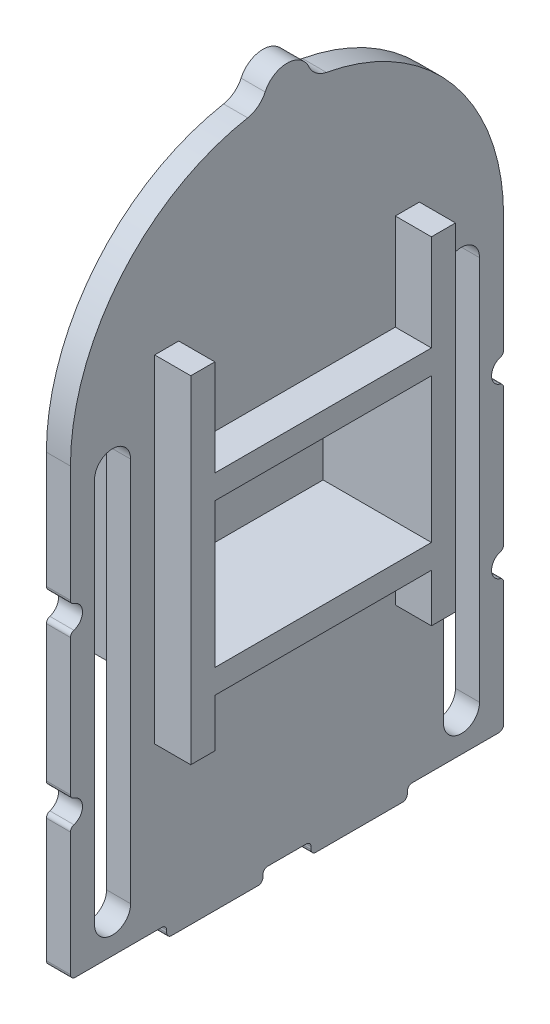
from build123d import *

# Parameters (mm, degrees)
EXTRUSION1_DEPTH        = 1
ESQUISSE2_W             = 11
ESQUISSE2_H             = 8
EXTRUSION2_DEPTH        = 3
CONG_1_R                = 1
EXTRUSION4_DEPTH        = 4
EXTRUSION4_DEPTH_BACK   = 4
CONG_2_R                = 0.2
ESQUISSE4_W             = 9
ESQUISSE4_H             = 6
ENL_V_MAT_EXTRU_1_DEPTH = 3
ESQUISSE5_W             = 9
ESQUISSE5_H             = 6
EXTRUSION5_DEPTH        = 1.5


with BuildPart() as part:
    # Esquisse1 → Extrusion1 (new body)
    with BuildSketch(Plane(origin=(0, 0, 0), x_dir=(0, 0, -1), z_dir=(1, 0, 0))):
        with BuildLine():
            Line((9, 0), (9, -5))
            ThreePointArc((9, -5), (8.5, -5.5), (9, -6))
            Line((9, -6), (9, -12))
            ThreePointArc((9, -12), (8.5, -12.5), (9, -13))
            Line((9, -13), (9, -18.5))
            Line((9, -18.5), (5, -18.5))
            Line((5, -18.5), (5, -19))
            Line((5, -19), (1, -19))
            Line((1, -19), (1, -18.5))
            Line((1, -18.5), (-1, -18.5))
            Line((-1, -18.5), (-1, -19))
            Line((-1, -19), (-5, -19))
            Line((-5, -19), (-5, -18.5))
            Line((-5, -18.5), (-9, -18.5))
            Line((-9, -18.5), (-9, -13))
            ThreePointArc((-9, -13), (-8.5, -12.5), (-9, -12))
            Line((-9, -12), (-9, -6))
            ThreePointArc((-9, -6), (-8.5, -5.5), (-9, -5))
            Line((-9, -5), (-9, 0))
            ThreePointArc((-9, 0), (-6.918336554, 5.75644155), (-1.636306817, 8.85))
            ThreePointArc((-1.636306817, 8.85), (-1.203482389, 9.044522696), (-0.909059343, 9.416666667))
            ThreePointArc((-0.909059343, 9.416666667), (0, 10), (0.909059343, 9.416666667))
            ThreePointArc((0.909059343, 9.416666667), (1.203482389, 9.044522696), (1.636306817, 8.85))
            ThreePointArc((1.636306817, 8.85), (6.918336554, 5.75644155), (9, 0))
        make_face()
        with BuildLine():
            Line((6.5, -1), (6.5, -17))
            ThreePointArc((6.5, -17), (7.25, -17.75), (8, -17))
            Line((8, -17), (8, -1))
            ThreePointArc((8, -1), (7.25, -0.25), (6.5, -1))
        make_face(mode=Mode.SUBTRACT)
        with BuildLine():
            Line((-8, -1), (-8, -17))
            ThreePointArc((-8, -17), (-7.25, -17.75), (-6.5, -17))
            Line((-6.5, -17), (-6.5, -1))
            ThreePointArc((-6.5, -1), (-7.25, -0.25), (-8, -1))
        make_face(mode=Mode.SUBTRACT)
    extrude(amount=EXTRUSION1_DEPTH)

    # Esquisse2 → Extrusion2 (add)
    with BuildSketch(Plane.ZY):
        with Locations((0, -5.75)):
            Rectangle(ESQUISSE2_W, ESQUISSE2_H)
    extrude(amount=EXTRUSION2_DEPTH)

    # Cong_1
    cong_1_edges = [part.edges().sort_by_distance(p)[0] for p in [
        (-3, -5.75, -5.5),
        (-3, -9.75, 0),
        (-3, -5.75, 5.5),
        (-3, -1.75, 0),
    ]]
    fillet(cong_1_edges, radius=CONG_1_R)

    # Esquisse3 → Extrusion4 (add, two sides: drawn at the far end of the back side and taken through both)
    with BuildSketch(Plane.XY.offset(-EXTRUSION4_DEPTH_BACK)):
        with BuildLine():
            Line((-3, -5.25), (-3, -6.25))
            ThreePointArc((-3, -6.25), (-3.5, -5.75), (-3, -5.25))
        make_face()
        with BuildLine():
            Line((-3, -3.05), (-3, -4.05))
            ThreePointArc((-3, -4.05), (-3.5, -3.55), (-3, -3.05))
        make_face()
        with BuildLine():
            Line((-3, -7.45), (-3, -8.45))
            ThreePointArc((-3, -8.45), (-3.5, -7.95), (-3, -7.45))
        make_face()
    extrude(amount=EXTRUSION4_DEPTH + EXTRUSION4_DEPTH_BACK)

    # Cong_2
    cong_2_edges = [part.edges().sort_by_distance(p)[0] for p in [
        (0.5, -18.5, -9),
        (0.5, -18.5, -5),
        (0.5, -19, -5),
        (0.5, -19, -1),
        (0.5, -18.5, -1),
        (0.5, -18.5, 1),
        (0.5, -19, 1),
        (0.5, -19, 5),
        (0.5, -18.5, 5),
        (0.5, -18.5, 9),
        (0.5, -13, 9),
        (0.5, -12, 9),
        (0.5, -6, 9),
        (0.5, -5, 9),
        (0.5, -5, -9),
        (0.5, -6, -9),
        (0.5, -12, -9),
        (0.5, -13, -9),
    ]]
    fillet(cong_2_edges, radius=CONG_2_R)

    # Esquisse4 → Enl_v. mat.-Extru.1 (cut)
    with BuildSketch(Plane(origin=(1, 0, 0), x_dir=(0, 0, -1), z_dir=(1, 0, 0))):
        with Locations((0, -5.75)):
            Rectangle(ESQUISSE4_W, ESQUISSE4_H)
    extrude(amount=-ENL_V_MAT_EXTRU_1_DEPTH, mode=Mode.SUBTRACT)

    # Esquisse5 → Extrusion5 (add)
    with BuildSketch(Plane(origin=(1, 0, 0), x_dir=(0, 0, -1), z_dir=(1, 0, 0))):
        Polygon((-4.5, -1.75), (-4.5, 2.25), (-5.5, 2.25), (-5.5, -11.75), (-4.5, -11.75), (-4.5, -9.75), (4.5, -9.75), (4.5, -11.75), (5.5, -11.75), (5.5, 2.25), (4.5, 2.25), (4.5, -1.75), align=None)
        with Locations((0, -5.75)):
            Rectangle(ESQUISSE5_W, ESQUISSE5_H, mode=Mode.SUBTRACT)
    extrude(amount=EXTRUSION5_DEPTH)


solid = part.part
